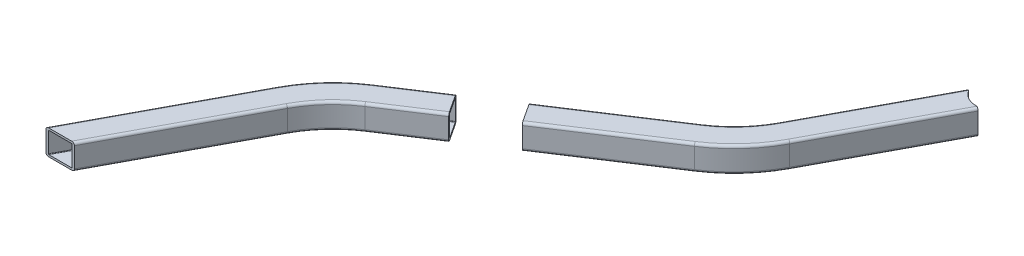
from build123d import *

# Parameters (mm, degrees)
ENL_V_MAT_EXTRU_1_DEPTH      = 369.509320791
ENL_V_MAT_EXTRU_1_DEPTH_BACK = 369.509320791
ENL_V_MAT_EXTRU_2_DEPTH      = 369.509320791
ENL_V_MAT_EXTRU_2_DEPTH_BACK = 369.509320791
ESQUISSE4_R                  = 19
ENL_V_MAT_EXTRU_3_DEPTH      = 355.70333418
ENL_V_MAT_EXTRU_3_DEPTH_BACK = 355.70333418
ENL_V_MAT_EXTRU_4_DEPTH      = 353.924765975
ENL_V_MAT_EXTRU_4_DEPTH_BACK = 353.924765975
ESQUISSE6_R                  = 3
ENL_V_MAT_EXTRU_5_DEPTH      = 354.588235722


with BuildPart() as part:
    # Balayage1: sweep along a path in Esquisse1
    with BuildLine(Plane(origin=(0, 0, 0), x_dir=(1, 0, 0), z_dir=(0, 1, 0))) as balayage1_path:
        Line((-193.978308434, -242.29225687), (-113.781753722, -92.397251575))
        ThreePointArc((-113.781753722, -92.397251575), (-96.02749876, -67.339587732), (-72.619306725, -47.461040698))
        Line((-72.619306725, -47.461040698), (125.852323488, 82.251986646))
        ThreePointArc((125.852323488, 82.251986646), (149.260515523, 102.13053368), (167.014770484, 127.188197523))
        Line((167.014770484, 127.188197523), (240, 263.604548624))
    # Esquisse2 → Balayage1 (sweep)
    with BuildSketch(Plane(origin=(-193.978308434, 0, 242.29225687), x_dir=(0.8817353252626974, 0, 0.4717444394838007), z_dir=(-0.4717444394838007, 0, 0.8817353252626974))):
        with BuildLine():
            Line((-10, 12.5), (10, 12.5))
            ThreePointArc((10, 12.5), (11.767766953, 11.767766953), (12.5, 10))
            Line((12.5, 10), (12.5, -10))
            ThreePointArc((12.5, -10), (11.767766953, -11.767766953), (10, -12.5))
            Line((10, -12.5), (-10, -12.5))
            ThreePointArc((-10, -12.5), (-11.767766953, -11.767766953), (-12.5, -10))
            Line((-12.5, -10), (-12.5, 10))
            ThreePointArc((-12.5, 10), (-11.767766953, 11.767766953), (-10, 12.5))
        make_face()
        with BuildLine():
            Line((-10, 10.5), (10, 10.5))
            ThreePointArc((10, 10.5), (10.353553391, 10.353553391), (10.5, 10))
            Line((10.5, 10), (10.5, -10))
            ThreePointArc((10.5, -10), (10.353553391, -10.353553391), (10, -10.5))
            Line((10, -10.5), (-10, -10.5))
            ThreePointArc((-10, -10.5), (-10.353553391, -10.353553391), (-10.5, -10))
            Line((-10.5, -10), (-10.5, 10))
            ThreePointArc((-10.5, 10), (-10.353553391, 10.353553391), (-10, 10.5))
        make_face(mode=Mode.SUBTRACT)
    sweep(path=balayage1_path.line)

    # Esquisse3 → Enl_v. mat.-Extru.1 (cut, two sides: drawn at the far end of the back side and taken through both)
    with BuildSketch(Plane(origin=(0, 0, 0), x_dir=(1, 0, 0), z_dir=(0, 1, 0)).offset(-ENL_V_MAT_EXTRU_1_DEPTH_BACK)):
        Polygon((-1577.185539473, -236.395451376), (-205, -236.395451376), (-176.646820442, -236.395451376), (1195.538719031, -236.395451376), (1195.538719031, -2980.766530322), (-1577.185539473, -2980.766530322), align=None)
    extrude(amount=ENL_V_MAT_EXTRU_1_DEPTH + ENL_V_MAT_EXTRU_1_DEPTH_BACK, mode=Mode.SUBTRACT)

    # Esquisse4 → Enl_v. mat.-Extru.2 (cut, two sides: drawn at the far end of the back side and taken through both)
    with BuildSketch(Plane(origin=(0, 0, 0), x_dir=(1, 0, 0), z_dir=(0, 1, 0)).offset(-ENL_V_MAT_EXTRU_2_DEPTH_BACK)):
        with Locations((240, 263.604548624)):
            Circle(ESQUISSE4_R)
    extrude(amount=ENL_V_MAT_EXTRU_2_DEPTH + ENL_V_MAT_EXTRU_2_DEPTH_BACK, mode=Mode.SUBTRACT)

    # Esquisse5 → Enl_v. mat.-Extru.3 (cut, two sides: drawn at the far end of the back side and taken through both)
    with BuildSketch(Plane(origin=(0, 0, 0), x_dir=(1, 0, 0), z_dir=(0, 1, 0)).offset(-ENL_V_MAT_EXTRU_3_DEPTH_BACK)):
        Polygon((-945.628240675, 879.614840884), (221.357043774, 255.256483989), (243.400426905, 243.462873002), (1410.385711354, -380.895483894), (2659.102425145, 1953.075085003), (303.088473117, 3213.585409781), align=None)
    extrude(amount=ENL_V_MAT_EXTRU_3_DEPTH + ENL_V_MAT_EXTRU_3_DEPTH_BACK, mode=Mode.SUBTRACT)

    # Esquisse6 → Enl_v. mat.-Extru.4 (cut, two sides: drawn at the far end of the back side and taken through both)
    with BuildSketch(Plane(origin=(0, 0, 0), x_dir=(1, 0, 0), z_dir=(0, 1, 0)).offset(-ENL_V_MAT_EXTRU_4_DEPTH_BACK)):
        Circle(ESQUISSE6_R)
    extrude(amount=ENL_V_MAT_EXTRU_4_DEPTH + ENL_V_MAT_EXTRU_4_DEPTH_BACK, mode=Mode.SUBTRACT)

    # Esquisse7 → Enl_v. mat.-Extru.5 (cut, through all)
    with BuildSketch(Plane(origin=(0, 12.5, 0), x_dir=(1, 0, 0), z_dir=(0, 1, 0))):
        Polygon((-15.344090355, -24.961147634), (29.02112247, 4.034160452), (15.344090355, 24.961147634), (-29.02112247, -4.034160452), align=None)
    extrude(amount=-ENL_V_MAT_EXTRU_5_DEPTH, mode=Mode.SUBTRACT)


with BuildPart() as enl_v_mat_extru_5_piece_1:
    # of the separate pieces the step leaves, piece 1, a body of its own (enl_v_mat_extru_5_pieces)
    add(part.part.solids().sort_by_distance((27.653419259, 12.5, -6.12685917))[0])


with BuildPart() as enl_v_mat_extru_5_piece_2:
    # of the separate pieces the step leaves, piece 2, a body of its own (enl_v_mat_extru_5_pieces)
    add(part.part.solids().sort_by_distance((-205, 10, 236.395451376))[0])


solid = Compound([enl_v_mat_extru_5_piece_1.part, enl_v_mat_extru_5_piece_2.part])
